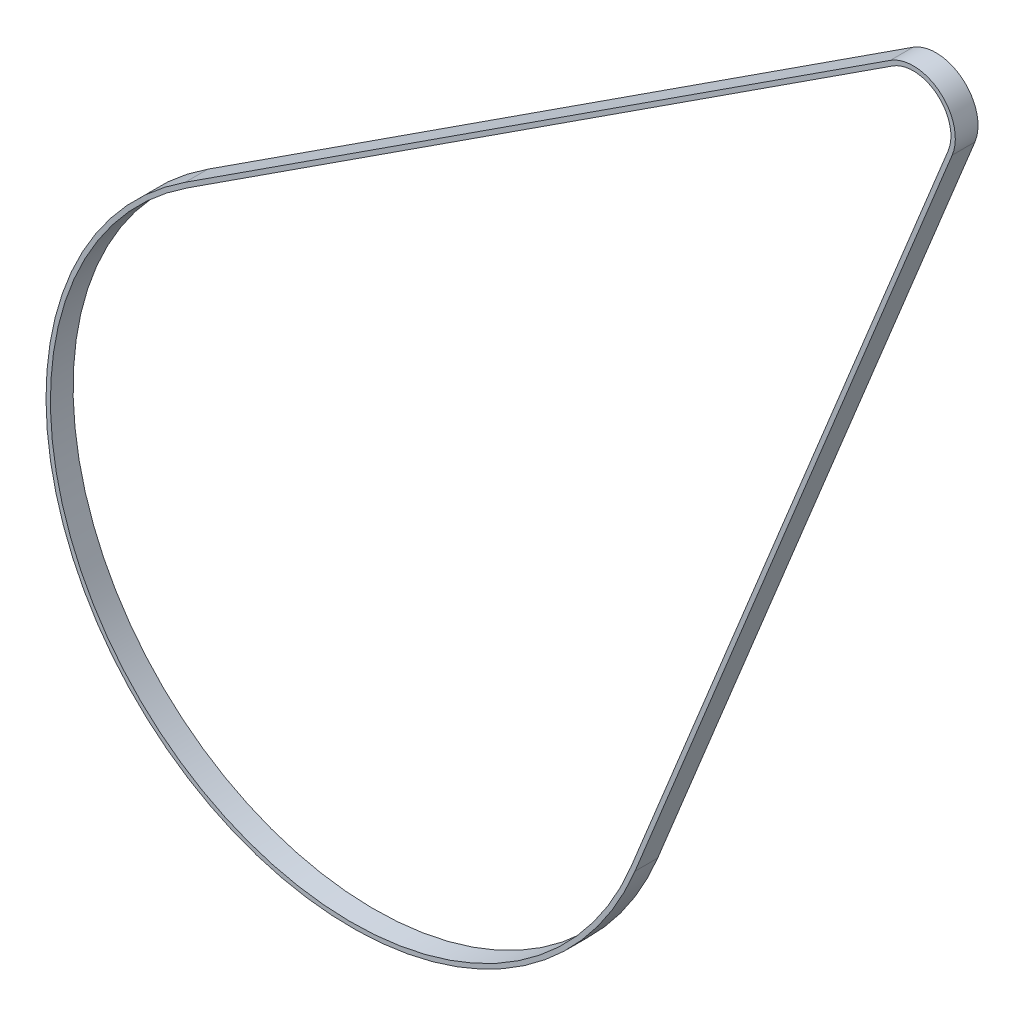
from build123d import *

# Parameters (mm, degrees)
EXTRUDE_THIN1_START = -2.08
EXTRUDE_THIN1_DEPTH = 1.295


with BuildPart() as part:
    # Sketch1 → Extrude-Thin1 (new, symmetric)
    with BuildSketch(Plane.XY.offset(32.5).offset(EXTRUDE_THIN1_START)):
        with BuildLine():
            Line((7.308072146, -110.661269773), (43.502866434, -21.810874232))
            ThreePointArc((43.502866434, -21.810874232), (42.115608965, -16.300223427), (36.442339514, -15.975001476))
            Line((36.442339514, -15.975001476), (-44.00719752, -68.246675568))
            ThreePointArc((-44.00719752, -68.246675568), (-47.225610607, -124.389640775), (7.308072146, -110.661269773))
        make_face()
        with BuildLine():
            Line((6.845019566, -110.472637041), (43.039813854, -21.622241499))
            ThreePointArc((43.039813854, -21.622241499), (41.797062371, -16.68561682), (36.714758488, -16.394272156))
            Line((36.714758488, -16.394272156), (-43.734778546, -68.665946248))
            ThreePointArc((-43.734778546, -68.665946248), (-46.907064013, -124.004247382), (6.845019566, -110.472637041))
        make_face(mode=Mode.SUBTRACT)
    extrude(amount=EXTRUDE_THIN1_DEPTH, both=True)


solid = part.part
